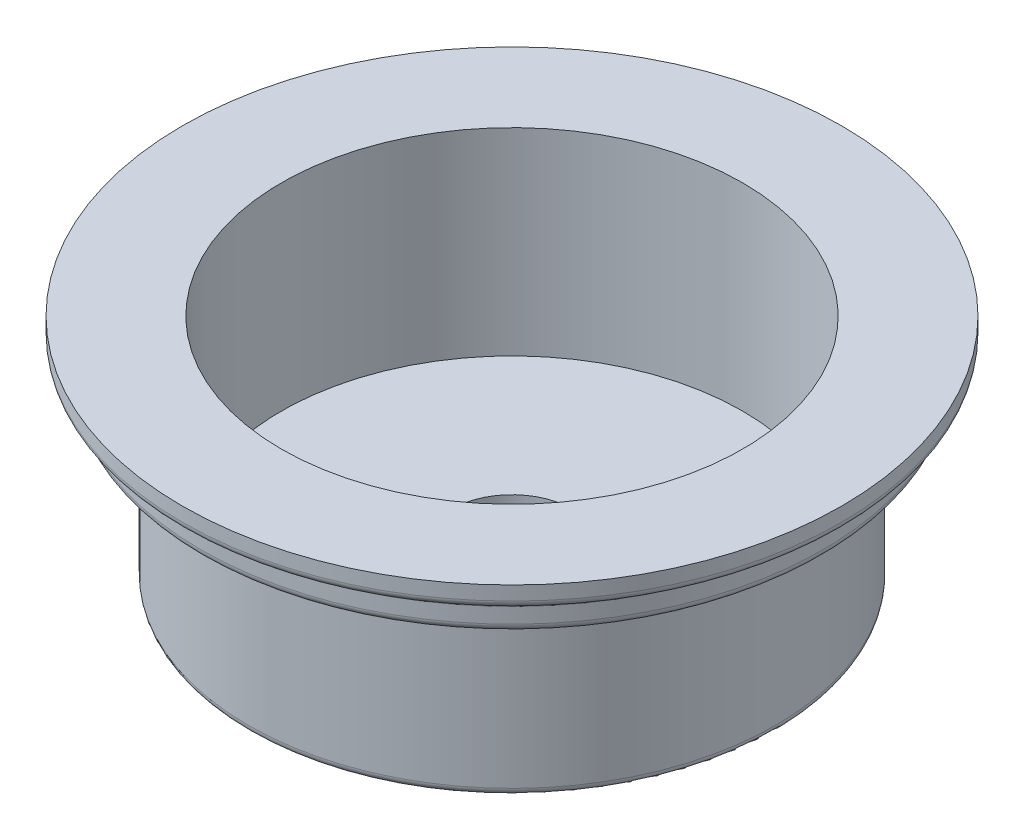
ISO-10303-21;
HEADER;
FILE_DESCRIPTION(('STEP AP214'),'2;1');
FILE_NAME('part.step','',(''),(''),'','','');
FILE_SCHEMA(('AUTOMOTIVE_DESIGN { 1 0 10303 214 1 1 1 1 }'));
ENDSEC;
DATA;
#1=APPLICATION_CONTEXT('core data for automotive mechanical design processes');
#2=APPLICATION_PROTOCOL_DEFINITION('international standard','automotive_design',2000,#1);
#3=PRODUCT_CONTEXT('',#1,'mechanical');
#4=PRODUCT('Part','Part','',(#3));
#5=PRODUCT_RELATED_PRODUCT_CATEGORY('part','',(#4));
#6=PRODUCT_DEFINITION_FORMATION('','',#4);
#7=PRODUCT_DEFINITION_CONTEXT('part definition',#1,'design');
#8=PRODUCT_DEFINITION('design','',#6,#7);
#9=PRODUCT_DEFINITION_SHAPE('','',#8);
#10=(LENGTH_UNIT() NAMED_UNIT(*) SI_UNIT(.MILLI.,.METRE.));
#11=(NAMED_UNIT(*) PLANE_ANGLE_UNIT() SI_UNIT($,.RADIAN.));
#12=(NAMED_UNIT(*) SI_UNIT($,.STERADIAN.) SOLID_ANGLE_UNIT());
#13=UNCERTAINTY_MEASURE_WITH_UNIT(LENGTH_MEASURE(1.E-05),#10,'distance_accuracy_value','');
#14=(GEOMETRIC_REPRESENTATION_CONTEXT(3) GLOBAL_UNCERTAINTY_ASSIGNED_CONTEXT((#13)) GLOBAL_UNIT_ASSIGNED_CONTEXT((#10,
#11,#12)) REPRESENTATION_CONTEXT('',''));
#15=CARTESIAN_POINT('',(0.,0.,0.));
#16=DIRECTION('',(0.,0.,1.));
#17=DIRECTION('',(1.,0.,0.));
#18=AXIS2_PLACEMENT_3D('',#15,#16,#17);
#19=CARTESIAN_POINT('',(19.05,-57.15,0.));
#20=DIRECTION('',(0.,1.,0.));
#21=DIRECTION('',(0.,0.,1.));
#22=AXIS2_PLACEMENT_3D('',#19,#20,#21);
#23=PLANE('',#22);
#24=CARTESIAN_POINT('',(0.,-57.149999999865,0.));
#25=DIRECTION('',(0.,-1.,0.));
#26=DIRECTION('',(0.,0.,-1.));
#27=AXIS2_PLACEMENT_3D('',#24,#25,#26);
#28=CIRCLE('',#27,13.1445);
#29=CARTESIAN_POINT('',(0.,-57.149999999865,-13.1445));
#30=VERTEX_POINT('',#29);
#31=EDGE_CURVE('E93',#30,#30,#28,.T.);
#32=ORIENTED_EDGE('',*,*,#31,.F.);
#33=EDGE_LOOP('',(#32));
#34=FACE_BOUND('',#33,.T.);
#35=CARTESIAN_POINT('',(0.,-57.15,0.));
#36=DIRECTION('',(0.,1.,0.));
#37=DIRECTION('',(0.,0.,1.));
#38=AXIS2_PLACEMENT_3D('',#35,#36,#37);
#39=CIRCLE('',#38,18.6902324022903);
#40=CARTESIAN_POINT('',(0.,-57.15,18.6902324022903));
#41=VERTEX_POINT('',#40);
#42=EDGE_CURVE('E72',#41,#41,#39,.F.);
#43=ORIENTED_EDGE('',*,*,#42,.T.);
#44=EDGE_LOOP('',(#43));
#45=FACE_BOUND('',#44,.T.);
#46=ADVANCED_FACE('F32',(#34,#45),#23,.F.);
#47=CARTESIAN_POINT('',(0.,-57.15,0.));
#48=DIRECTION('',(0.,1.,0.));
#49=DIRECTION('',(0.,0.,1.));
#50=AXIS2_PLACEMENT_3D('',#47,#48,#49);
#51=CONICAL_SURFACE('',#50,19.05,1.10714871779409);
#52=CARTESIAN_POINT('',(0.,-56.9891070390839,0.));
#53=DIRECTION('',(0.,-1.,0.));
#54=DIRECTION('',(0.,0.,-1.));
#55=AXIS2_PLACEMENT_3D('',#52,#53,#54);
#56=CIRCLE('',#55,19.3717859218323);
#57=CARTESIAN_POINT('',(0.,-56.9891070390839,-19.3717859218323));
#58=VERTEX_POINT('',#57);
#59=EDGE_CURVE('E75',#58,#58,#56,.F.);
#60=ORIENTED_EDGE('',*,*,#59,.T.);
#61=EDGE_LOOP('',(#60));
#62=FACE_BOUND('',#61,.T.);
#63=CARTESIAN_POINT('',(0.,-44.6108929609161,0.));
#64=DIRECTION('',(0.,1.,0.));
#65=DIRECTION('',(0.,0.,1.));
#66=AXIS2_PLACEMENT_3D('',#63,#64,#65);
#67=CIRCLE('',#66,44.1282140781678);
#68=CARTESIAN_POINT('',(0.,-44.6108929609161,44.1282140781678));
#69=VERTEX_POINT('',#68);
#70=EDGE_CURVE('E78',#69,#69,#67,.F.);
#71=ORIENTED_EDGE('',*,*,#70,.T.);
#72=EDGE_LOOP('',(#71));
#73=FACE_BOUND('',#72,.T.);
#74=ADVANCED_FACE('F121',(#62,#73),#51,.T.);
#75=CARTESIAN_POINT('',(50.8,-44.45,0.));
#76=DIRECTION('',(0.,1.,0.));
#77=DIRECTION('',(0.,0.,1.));
#78=AXIS2_PLACEMENT_3D('',#75,#76,#77);
#79=PLANE('',#78);
#80=CARTESIAN_POINT('',(0.,-44.45,0.));
#81=DIRECTION('',(0.,1.,0.));
#82=DIRECTION('',(0.,0.,1.));
#83=AXIS2_PLACEMENT_3D('',#80,#81,#82);
#84=CIRCLE('',#83,44.8097675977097);
#85=CARTESIAN_POINT('',(0.,-44.45,44.8097675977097));
#86=VERTEX_POINT('',#85);
#87=EDGE_CURVE('E66',#86,#86,#84,.T.);
#88=ORIENTED_EDGE('',*,*,#87,.T.);
#89=EDGE_LOOP('',(#88));
#90=FACE_BOUND('',#89,.T.);
#91=CARTESIAN_POINT('',(0.,-44.45,0.));
#92=DIRECTION('',(0.,1.,0.));
#93=DIRECTION('',(0.,0.,1.));
#94=AXIS2_PLACEMENT_3D('',#91,#92,#93);
#95=CIRCLE('',#94,49.276);
#96=CARTESIAN_POINT('',(0.,-44.45,49.276));
#97=VERTEX_POINT('',#96);
#98=EDGE_CURVE('E69',#97,#97,#95,.F.);
#99=ORIENTED_EDGE('',*,*,#98,.T.);
#100=EDGE_LOOP('',(#99));
#101=FACE_BOUND('',#100,.T.);
#102=ADVANCED_FACE('F134',(#90,#101),#79,.F.);
#103=CARTESIAN_POINT('',(0.,0.,0.));
#104=DIRECTION('',(0.,1.,0.));
#105=DIRECTION('',(0.,0.,1.));
#106=AXIS2_PLACEMENT_3D('',#103,#104,#105);
#107=CYLINDRICAL_SURFACE('',#106,50.8);
#108=CARTESIAN_POINT('',(0.,-42.926,0.));
#109=DIRECTION('',(0.,1.,0.));
#110=DIRECTION('',(0.,0.,1.));
#111=AXIS2_PLACEMENT_3D('',#108,#109,#110);
#112=CIRCLE('',#111,50.8);
#113=CARTESIAN_POINT('',(0.,-42.926,50.8));
#114=VERTEX_POINT('',#113);
#115=EDGE_CURVE('E60',#114,#114,#112,.T.);
#116=ORIENTED_EDGE('',*,*,#115,.T.);
#117=EDGE_LOOP('',(#116));
#118=FACE_BOUND('',#117,.T.);
#119=CARTESIAN_POINT('',(0.,-14.5287382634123,0.));
#120=DIRECTION('',(0.,1.,0.));
#121=DIRECTION('',(0.,0.,1.));
#122=AXIS2_PLACEMENT_3D('',#119,#120,#121);
#123=CIRCLE('',#122,50.8);
#124=CARTESIAN_POINT('',(0.,-14.5287382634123,50.8));
#125=VERTEX_POINT('',#124);
#126=EDGE_CURVE('E63',#125,#125,#123,.F.);
#127=ORIENTED_EDGE('',*,*,#126,.T.);
#128=EDGE_LOOP('',(#127));
#129=FACE_BOUND('',#128,.T.);
#130=ADVANCED_FACE('F145',(#118,#129),#107,.T.);
#131=CARTESIAN_POINT('',(0.,-13.4616219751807,0.));
#132=DIRECTION('',(0.,1.,0.));
#133=DIRECTION('',(0.,0.,1.));
#134=AXIS2_PLACEMENT_3D('',#131,#132,#133);
#135=CONICAL_SURFACE('',#134,50.8,1.22173047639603);
#136=CARTESIAN_POINT('',(0.,-10.5076982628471,0.));
#137=DIRECTION('',(0.,-1.,0.));
#138=DIRECTION('',(0.,0.,-1.));
#139=AXIS2_PLACEMENT_3D('',#136,#137,#138);
#140=CIRCLE('',#139,58.9158386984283);
#141=CARTESIAN_POINT('',(0.,-10.5076982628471,-58.9158386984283));
#142=VERTEX_POINT('',#141);
#143=EDGE_CURVE('E10',#142,#142,#140,.T.);
#144=ORIENTED_EDGE('',*,*,#143,.T.);
#145=EDGE_LOOP('',(#144));
#146=FACE_BOUND('',#145,.T.);
#147=CARTESIAN_POINT('',(0.,-13.0966467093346,0.));
#148=DIRECTION('',(0.,1.,0.));
#149=DIRECTION('',(0.,0.,1.));
#150=AXIS2_PLACEMENT_3D('',#147,#148,#149);
#151=CIRCLE('',#150,51.8027613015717);
#152=CARTESIAN_POINT('',(0.,-13.0966467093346,51.8027613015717));
#153=VERTEX_POINT('',#152);
#154=EDGE_CURVE('E39',#153,#153,#151,.T.);
#155=ORIENTED_EDGE('',*,*,#154,.T.);
#156=EDGE_LOOP('',(#155));
#157=FACE_BOUND('',#156,.T.);
#158=ADVANCED_FACE('F157',(#146,#157),#135,.T.);
#159=CARTESIAN_POINT('',(0.,0.,0.));
#160=DIRECTION('',(0.,1.,0.));
#161=DIRECTION('',(0.,0.,1.));
#162=AXIS2_PLACEMENT_3D('',#159,#160,#161);
#163=CYLINDRICAL_SURFACE('',#162,59.9186);
#164=CARTESIAN_POINT('',(0.,-6.12983928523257,0.));
#165=DIRECTION('',(0.,1.,0.));
#166=DIRECTION('',(0.,0.,1.));
#167=AXIS2_PLACEMENT_3D('',#164,#165,#166);
#168=CIRCLE('',#167,59.9186);
#169=CARTESIAN_POINT('',(0.,-6.12983928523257,59.9186));
#170=VERTEX_POINT('',#169);
#171=EDGE_CURVE('E48',#170,#170,#168,.F.);
#172=ORIENTED_EDGE('',*,*,#171,.T.);
#173=EDGE_LOOP('',(#172));
#174=FACE_BOUND('',#173,.T.);
#175=CARTESIAN_POINT('',(0.,-9.07560670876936,0.));
#176=DIRECTION('',(0.,-1.,0.));
#177=DIRECTION('',(0.,0.,-1.));
#178=AXIS2_PLACEMENT_3D('',#175,#176,#177);
#179=CIRCLE('',#178,59.9186);
#180=CARTESIAN_POINT('',(0.,-9.07560670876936,-59.9186));
#181=VERTEX_POINT('',#180);
#182=EDGE_CURVE('E51',#181,#181,#179,.F.);
#183=ORIENTED_EDGE('',*,*,#182,.T.);
#184=EDGE_LOOP('',(#183));
#185=FACE_BOUND('',#184,.T.);
#186=ADVANCED_FACE('F168',(#174,#185),#163,.T.);
#187=CARTESIAN_POINT('',(0.,-5.06272299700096,0.));
#188=DIRECTION('',(0.,1.,0.));
#189=DIRECTION('',(0.,0.,1.));
#190=AXIS2_PLACEMENT_3D('',#187,#188,#189);
#191=CONICAL_SURFACE('',#190,59.9186,1.22173047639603);
#192=CARTESIAN_POINT('',(0.,-4.69774773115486,0.));
#193=DIRECTION('',(0.,1.,0.));
#194=DIRECTION('',(0.,0.,1.));
#195=AXIS2_PLACEMENT_3D('',#192,#193,#194);
#196=CIRCLE('',#195,60.9213613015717);
#197=CARTESIAN_POINT('',(0.,-4.69774773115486,60.9213613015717));
#198=VERTEX_POINT('',#197);
#199=EDGE_CURVE('E54',#198,#198,#196,.T.);
#200=ORIENTED_EDGE('',*,*,#199,.T.);
#201=EDGE_LOOP('',(#200));
#202=FACE_BOUND('',#201,.T.);
#203=CARTESIAN_POINT('',(0.,-4.12417526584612,0.));
#204=DIRECTION('',(0.,-1.,0.));
#205=DIRECTION('',(0.,0.,-1.));
#206=AXIS2_PLACEMENT_3D('',#203,#204,#205);
#207=CIRCLE('',#206,62.4972386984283);
#208=CARTESIAN_POINT('',(0.,-4.12417526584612,-62.4972386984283));
#209=VERTEX_POINT('',#208);
#210=EDGE_CURVE('E57',#209,#209,#207,.T.);
#211=ORIENTED_EDGE('',*,*,#210,.T.);
#212=EDGE_LOOP('',(#211));
#213=FACE_BOUND('',#212,.T.);
#214=ADVANCED_FACE('F173',(#202,#213),#191,.T.);
#215=CARTESIAN_POINT('',(0.,0.,0.));
#216=DIRECTION('',(0.,1.,0.));
#217=DIRECTION('',(0.,0.,1.));
#218=AXIS2_PLACEMENT_3D('',#215,#216,#217);
#219=CYLINDRICAL_SURFACE('',#218,63.5);
#220=CARTESIAN_POINT('',(0.,-2.6920837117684,0.));
#221=DIRECTION('',(0.,-1.,0.));
#222=DIRECTION('',(0.,0.,-1.));
#223=AXIS2_PLACEMENT_3D('',#220,#221,#222);
#224=CIRCLE('',#223,63.5);
#225=CARTESIAN_POINT('',(0.,-2.6920837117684,-63.5));
#226=VERTEX_POINT('',#225);
#227=EDGE_CURVE('E43',#226,#226,#224,.F.);
#228=ORIENTED_EDGE('',*,*,#227,.T.);
#229=EDGE_LOOP('',(#228));
#230=FACE_BOUND('',#229,.T.);
#231=CARTESIAN_POINT('',(0.,0.,0.));
#232=DIRECTION('',(0.,1.,0.));
#233=DIRECTION('',(0.,0.,1.));
#234=AXIS2_PLACEMENT_3D('',#231,#232,#233);
#235=CIRCLE('',#234,63.5);
#236=CARTESIAN_POINT('',(0.,0.,63.5));
#237=VERTEX_POINT('',#236);
#238=EDGE_CURVE('E81',#237,#237,#235,.T.);
#239=ORIENTED_EDGE('',*,*,#238,.F.);
#240=EDGE_LOOP('',(#239));
#241=FACE_BOUND('',#240,.T.);
#242=ADVANCED_FACE('F179',(#230,#241),#219,.T.);
#243=CARTESIAN_POINT('',(54.7751,0.,0.));
#244=DIRECTION('',(0.,-1.,0.));
#245=DIRECTION('',(0.,0.,-1.));
#246=AXIS2_PLACEMENT_3D('',#243,#244,#245);
#247=PLANE('',#246);
#248=CARTESIAN_POINT('',(0.,0.,0.));
#249=DIRECTION('',(0.,1.,0.));
#250=DIRECTION('',(0.,0.,1.));
#251=AXIS2_PLACEMENT_3D('',#248,#249,#250);
#252=CIRCLE('',#251,44.45);
#253=CARTESIAN_POINT('',(0.,0.,44.45));
#254=VERTEX_POINT('',#253);
#255=EDGE_CURVE('E84',#254,#254,#252,.T.);
#256=ORIENTED_EDGE('',*,*,#255,.F.);
#257=EDGE_LOOP('',(#256));
#258=FACE_BOUND('',#257,.T.);
#259=ORIENTED_EDGE('',*,*,#238,.T.);
#260=EDGE_LOOP('',(#259));
#261=FACE_BOUND('',#260,.T.);
#262=ADVANCED_FACE('F183',(#258,#261),#247,.F.);
#263=CARTESIAN_POINT('',(0.,0.,0.));
#264=DIRECTION('',(0.,1.,0.));
#265=DIRECTION('',(0.,0.,1.));
#266=AXIS2_PLACEMENT_3D('',#263,#264,#265);
#267=CYLINDRICAL_SURFACE('',#266,44.45);
#268=CARTESIAN_POINT('',(0.,-38.1,0.));
#269=DIRECTION('',(0.,1.,0.));
#270=DIRECTION('',(0.,0.,1.));
#271=AXIS2_PLACEMENT_3D('',#268,#269,#270);
#272=CIRCLE('',#271,44.45);
#273=CARTESIAN_POINT('',(0.,-38.1,44.45));
#274=VERTEX_POINT('',#273);
#275=EDGE_CURVE('E87',#274,#274,#272,.T.);
#276=ORIENTED_EDGE('',*,*,#275,.F.);
#277=EDGE_LOOP('',(#276));
#278=FACE_BOUND('',#277,.T.);
#279=ORIENTED_EDGE('',*,*,#255,.T.);
#280=EDGE_LOOP('',(#279));
#281=FACE_BOUND('',#280,.T.);
#282=ADVANCED_FACE('F187',(#278,#281),#267,.F.);
#283=CARTESIAN_POINT('',(0.,-38.1,0.));
#284=DIRECTION('',(0.,-1.,0.));
#285=DIRECTION('',(0.,0.,-1.));
#286=AXIS2_PLACEMENT_3D('',#283,#284,#285);
#287=PLANE('',#286);
#288=CARTESIAN_POINT('',(0.,-38.1,0.));
#289=DIRECTION('',(0.,-1.,0.));
#290=DIRECTION('',(0.,0.,-1.));
#291=AXIS2_PLACEMENT_3D('',#288,#289,#290);
#292=CIRCLE('',#291,11.6967);
#293=CARTESIAN_POINT('',(0.,-38.1,-11.6967));
#294=VERTEX_POINT('',#293);
#295=EDGE_CURVE('E96',#294,#294,#292,.T.);
#296=ORIENTED_EDGE('',*,*,#295,.T.);
#297=EDGE_LOOP('',(#296));
#298=FACE_BOUND('',#297,.T.);
#299=ORIENTED_EDGE('',*,*,#275,.T.);
#300=EDGE_LOOP('',(#299));
#301=FACE_BOUND('',#300,.T.);
#302=ADVANCED_FACE('F128',(#298,#301),#287,.F.);
#303=CARTESIAN_POINT('',(0.,-55.626,0.));
#304=DIRECTION('',(0.,1.,0.));
#305=DIRECTION('',(0.,0.,1.));
#306=AXIS2_PLACEMENT_3D('',#303,#304,#305);
#307=TOROIDAL_SURFACE('',#306,18.6902324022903,1.524);
#308=ORIENTED_EDGE('',*,*,#42,.F.);
#309=EDGE_LOOP('',(#308));
#310=FACE_BOUND('',#309,.T.);
#311=ORIENTED_EDGE('',*,*,#59,.F.);
#312=EDGE_LOOP('',(#311));
#313=FACE_BOUND('',#312,.T.);
#314=ADVANCED_FACE('F124',(#310,#313),#307,.T.);
#315=CARTESIAN_POINT('',(0.,-45.974,0.));
#316=DIRECTION('',(0.,1.,0.));
#317=DIRECTION('',(0.,0.,1.));
#318=AXIS2_PLACEMENT_3D('',#315,#316,#317);
#319=TOROIDAL_SURFACE('',#318,44.8097675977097,1.524);
#320=ORIENTED_EDGE('',*,*,#70,.F.);
#321=EDGE_LOOP('',(#320));
#322=FACE_BOUND('',#321,.T.);
#323=ORIENTED_EDGE('',*,*,#87,.F.);
#324=EDGE_LOOP('',(#323));
#325=FACE_BOUND('',#324,.T.);
#326=ADVANCED_FACE('F127',(#322,#325),#319,.F.);
#327=CARTESIAN_POINT('',(0.,-42.926,0.));
#328=DIRECTION('',(0.,1.,0.));
#329=DIRECTION('',(0.,0.,1.));
#330=AXIS2_PLACEMENT_3D('',#327,#328,#329);
#331=TOROIDAL_SURFACE('',#330,49.276,1.524);
#332=ORIENTED_EDGE('',*,*,#98,.F.);
#333=EDGE_LOOP('',(#332));
#334=FACE_BOUND('',#333,.T.);
#335=ORIENTED_EDGE('',*,*,#115,.F.);
#336=EDGE_LOOP('',(#335));
#337=FACE_BOUND('',#336,.T.);
#338=ADVANCED_FACE('F139',(#334,#337),#331,.T.);
#339=CARTESIAN_POINT('',(0.,-6.12983928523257,0.));
#340=DIRECTION('',(0.,1.,0.));
#341=DIRECTION('',(0.,0.,1.));
#342=AXIS2_PLACEMENT_3D('',#339,#340,#341);
#343=TOROIDAL_SURFACE('',#342,61.4426,1.524);
#344=ORIENTED_EDGE('',*,*,#171,.F.);
#345=EDGE_LOOP('',(#344));
#346=FACE_BOUND('',#345,.T.);
#347=ORIENTED_EDGE('',*,*,#199,.F.);
#348=EDGE_LOOP('',(#347));
#349=FACE_BOUND('',#348,.T.);
#350=ADVANCED_FACE('F151',(#346,#349),#343,.F.);
#351=CARTESIAN_POINT('',(0.,-2.6920837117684,0.));
#352=DIRECTION('',(0.,-1.,0.));
#353=DIRECTION('',(0.,0.,-1.));
#354=AXIS2_PLACEMENT_3D('',#351,#352,#353);
#355=TOROIDAL_SURFACE('',#354,61.976,1.524);
#356=ORIENTED_EDGE('',*,*,#210,.F.);
#357=EDGE_LOOP('',(#356));
#358=FACE_BOUND('',#357,.T.);
#359=ORIENTED_EDGE('',*,*,#227,.F.);
#360=EDGE_LOOP('',(#359));
#361=FACE_BOUND('',#360,.T.);
#362=ADVANCED_FACE('F196',(#358,#361),#355,.T.);
#363=CARTESIAN_POINT('',(0.,-9.07560670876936,0.));
#364=DIRECTION('',(0.,-1.,0.));
#365=DIRECTION('',(0.,0.,-1.));
#366=AXIS2_PLACEMENT_3D('',#363,#364,#365);
#367=TOROIDAL_SURFACE('',#366,58.3946,1.524);
#368=ORIENTED_EDGE('',*,*,#143,.F.);
#369=EDGE_LOOP('',(#368));
#370=FACE_BOUND('',#369,.T.);
#371=ORIENTED_EDGE('',*,*,#182,.F.);
#372=EDGE_LOOP('',(#371));
#373=FACE_BOUND('',#372,.T.);
#374=ADVANCED_FACE('F163',(#370,#373),#367,.T.);
#375=CARTESIAN_POINT('',(0.,-14.5287382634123,0.));
#376=DIRECTION('',(0.,1.,0.));
#377=DIRECTION('',(0.,0.,1.));
#378=AXIS2_PLACEMENT_3D('',#375,#376,#377);
#379=TOROIDAL_SURFACE('',#378,52.324,1.524);
#380=ORIENTED_EDGE('',*,*,#126,.F.);
#381=EDGE_LOOP('',(#380));
#382=FACE_BOUND('',#381,.T.);
#383=ORIENTED_EDGE('',*,*,#154,.F.);
#384=EDGE_LOOP('',(#383));
#385=FACE_BOUND('',#384,.T.);
#386=ADVANCED_FACE('F115',(#382,#385),#379,.F.);
#387=CARTESIAN_POINT('',(0.,-57.149999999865,0.));
#388=DIRECTION('',(0.,-1.,0.));
#389=DIRECTION('',(0.,0.,-1.));
#390=AXIS2_PLACEMENT_3D('',#387,#388,#389);
#391=CONICAL_SURFACE('',#390,13.1445,0.0311250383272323);
#392=CARTESIAN_POINT('',(0.,-43.096179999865,0.));
#393=DIRECTION('',(0.,-1.,0.));
#394=DIRECTION('',(0.,0.,-1.));
#395=AXIS2_PLACEMENT_3D('',#392,#393,#394);
#396=CIRCLE('',#395,12.7069330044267);
#397=CARTESIAN_POINT('',(0.,-43.096179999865,-12.7069330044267));
#398=VERTEX_POINT('',#397);
#399=EDGE_CURVE('E90',#398,#398,#396,.T.);
#400=ORIENTED_EDGE('',*,*,#399,.F.);
#401=EDGE_LOOP('',(#400));
#402=FACE_BOUND('',#401,.T.);
#403=ORIENTED_EDGE('',*,*,#31,.T.);
#404=EDGE_LOOP('',(#403));
#405=FACE_BOUND('',#404,.T.);
#406=ADVANCED_FACE('F109',(#402,#405),#391,.F.);
#407=CARTESIAN_POINT('',(0.,-43.096179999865,0.));
#408=DIRECTION('',(0.,-1.,0.));
#409=DIRECTION('',(0.,0.,-1.));
#410=AXIS2_PLACEMENT_3D('',#407,#408,#409);
#411=PLANE('',#410);
#412=CARTESIAN_POINT('',(0.,-43.096179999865,0.));
#413=DIRECTION('',(0.,-1.,0.));
#414=DIRECTION('',(0.,0.,-1.));
#415=AXIS2_PLACEMENT_3D('',#412,#413,#414);
#416=CIRCLE('',#415,11.6967);
#417=CARTESIAN_POINT('',(0.,-43.096179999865,-11.6967));
#418=VERTEX_POINT('',#417);
#419=EDGE_CURVE('E35',#418,#418,#416,.T.);
#420=ORIENTED_EDGE('',*,*,#419,.F.);
#421=EDGE_LOOP('',(#420));
#422=FACE_BOUND('',#421,.T.);
#423=ORIENTED_EDGE('',*,*,#399,.T.);
#424=EDGE_LOOP('',(#423));
#425=FACE_BOUND('',#424,.T.);
#426=ADVANCED_FACE('F106',(#422,#425),#411,.T.);
#427=CARTESIAN_POINT('',(0.,-19.05,0.));
#428=DIRECTION('',(0.,-1.,0.));
#429=DIRECTION('',(0.,0.,-1.));
#430=AXIS2_PLACEMENT_3D('',#427,#428,#429);
#431=CYLINDRICAL_SURFACE('',#430,11.6967);
#432=CARTESIAN_POINT('',(0.,-43.096179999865,-11.6967));
#433=CARTESIAN_POINT('',(0.,-43.0441364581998,-11.6967));
#434=CARTESIAN_POINT('',(0.,-42.9920929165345,-11.6967));
#435=CARTESIAN_POINT('',(0.,-42.888005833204,-11.6967));
#436=CARTESIAN_POINT('',(0.,-42.8359622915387,-11.6967));
#437=CARTESIAN_POINT('',(0.,-42.7318752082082,-11.6967));
#438=CARTESIAN_POINT('',(0.,-42.6798316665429,-11.6967));
#439=CARTESIAN_POINT('',(0.,-42.5757445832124,-11.6967));
#440=CARTESIAN_POINT('',(0.,-42.5237010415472,-11.6967));
#441=CARTESIAN_POINT('',(0.,-42.4196139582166,-11.6967));
#442=CARTESIAN_POINT('',(0.,-42.3675704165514,-11.6967));
#443=CARTESIAN_POINT('',(0.,-42.2634833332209,-11.6967));
#444=CARTESIAN_POINT('',(0.,-42.2114397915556,-11.6967));
#445=CARTESIAN_POINT('',(0.,-42.1073527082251,-11.6967));
#446=CARTESIAN_POINT('',(0.,-42.0553091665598,-11.6967));
#447=CARTESIAN_POINT('',(0.,-41.9512220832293,-11.6967));
#448=CARTESIAN_POINT('',(0.,-41.899178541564,-11.6967));
#449=CARTESIAN_POINT('',(0.,-41.7950914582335,-11.6967));
#450=CARTESIAN_POINT('',(0.,-41.7430479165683,-11.6967));
#451=CARTESIAN_POINT('',(0.,-41.6389608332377,-11.6967));
#452=CARTESIAN_POINT('',(0.,-41.5869172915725,-11.6967));
#453=CARTESIAN_POINT('',(0.,-41.4828302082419,-11.6967));
#454=CARTESIAN_POINT('',(0.,-41.4307866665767,-11.6967));
#455=CARTESIAN_POINT('',(0.,-41.3266995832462,-11.6967));
#456=CARTESIAN_POINT('',(0.,-41.2746560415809,-11.6967));
#457=CARTESIAN_POINT('',(0.,-41.1705689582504,-11.6967));
#458=CARTESIAN_POINT('',(0.,-41.1185254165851,-11.6967));
#459=CARTESIAN_POINT('',(0.,-41.0144383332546,-11.6967));
#460=CARTESIAN_POINT('',(0.,-40.9623947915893,-11.6967));
#461=CARTESIAN_POINT('',(0.,-40.8583077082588,-11.6967));
#462=CARTESIAN_POINT('',(0.,-40.8062641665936,-11.6967));
#463=CARTESIAN_POINT('',(0.,-40.702177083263,-11.6967));
#464=CARTESIAN_POINT('',(0.,-40.6501335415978,-11.6967));
#465=CARTESIAN_POINT('',(0.,-40.5460464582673,-11.6967));
#466=CARTESIAN_POINT('',(0.,-40.494002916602,-11.6967));
#467=CARTESIAN_POINT('',(0.,-40.3899158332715,-11.6967));
#468=CARTESIAN_POINT('',(0.,-40.3378722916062,-11.6967));
#469=CARTESIAN_POINT('',(0.,-40.2337852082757,-11.6967));
#470=CARTESIAN_POINT('',(0.,-40.1817416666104,-11.6967));
#471=CARTESIAN_POINT('',(0.,-40.0776545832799,-11.6967));
#472=CARTESIAN_POINT('',(0.,-40.0256110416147,-11.6967));
#473=CARTESIAN_POINT('',(0.,-39.9215239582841,-11.6967));
#474=CARTESIAN_POINT('',(0.,-39.8694804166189,-11.6967));
#475=CARTESIAN_POINT('',(0.,-39.7653933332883,-11.6967));
#476=CARTESIAN_POINT('',(0.,-39.7133497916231,-11.6967));
#477=CARTESIAN_POINT('',(0.,-39.6092627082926,-11.6967));
#478=CARTESIAN_POINT('',(0.,-39.5572191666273,-11.6967));
#479=CARTESIAN_POINT('',(0.,-39.4531320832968,-11.6967));
#480=CARTESIAN_POINT('',(0.,-39.4010885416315,-11.6967));
#481=CARTESIAN_POINT('',(0.,-39.297001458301,-11.6967));
#482=CARTESIAN_POINT('',(0.,-39.2449579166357,-11.6967));
#483=CARTESIAN_POINT('',(0.,-39.1408708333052,-11.6967));
#484=CARTESIAN_POINT('',(0.,-39.08882729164,-11.6967));
#485=CARTESIAN_POINT('',(0.,-38.9847402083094,-11.6967));
#486=CARTESIAN_POINT('',(0.,-38.9326966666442,-11.6967));
#487=CARTESIAN_POINT('',(0.,-38.8286095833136,-11.6967));
#488=CARTESIAN_POINT('',(0.,-38.7765660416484,-11.6967));
#489=CARTESIAN_POINT('',(0.,-38.6724789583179,-11.6967));
#490=CARTESIAN_POINT('',(0.,-38.6204354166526,-11.6967));
#491=CARTESIAN_POINT('',(0.,-38.5163483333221,-11.6967));
#492=CARTESIAN_POINT('',(0.,-38.4643047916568,-11.6967));
#493=CARTESIAN_POINT('',(0.,-38.3602177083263,-11.6967));
#494=CARTESIAN_POINT('',(0.,-38.308174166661,-11.6967));
#495=CARTESIAN_POINT('',(0.,-38.2040870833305,-11.6967));
#496=CARTESIAN_POINT('',(0.,-38.1520435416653,-11.6967));
#497=CARTESIAN_POINT('',(0.,-38.1,-11.6967));
#498=B_SPLINE_CURVE_WITH_KNOTS('',3,(#432,#433,#434,#435,#436,#437,#438,#439,#440,#441,#442,
#443,#444,#445,#446,#447,#448,#449,#450,#451,#452,#453,#454,#455,#456,#457,#458,#459,#460,#461,
#462,#463,#464,#465,#466,#467,#468,#469,#470,#471,#472,#473,#474,#475,#476,#477,#478,#479,#480,
#481,#482,#483,#484,#485,#486,#487,#488,#489,#490,#491,#492,#493,#494,#495,#496,#497),
.UNSPECIFIED.,.F.,.F.,(4,2,2,2,2,2,2,2,2,2,2,2,2,2,2,2,2,2,2,2,2,2,2,2,2,2,2,2,2,2,2,2,4),(0.,
0.156130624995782,0.312261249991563,0.468391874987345,0.624522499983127,0.780653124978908,
0.93678374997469,1.09291437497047,1.24904499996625,1.40517562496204,1.56130624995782,
1.7174368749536,1.87356749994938,2.02969812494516,2.18582874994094,2.34195937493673,
2.49808999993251,2.65422062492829,2.81035124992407,2.96648187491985,3.12261249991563,
3.27874312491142,3.4348737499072,3.59100437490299,3.74713499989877,3.90326562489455,
4.05939624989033,4.21552687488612,4.3716574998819,4.52778812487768,4.68391874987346,
4.84004937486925,4.99617999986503),.UNSPECIFIED.);
#499=EDGE_CURVE('BSEAM103',#418,#294,#498,.T.);
#500=ORIENTED_EDGE('',*,*,#419,.T.);
#501=ORIENTED_EDGE('',*,*,#295,.F.);
#502=ORIENTED_EDGE('',*,*,#499,.T.);
#503=ORIENTED_EDGE('',*,*,#499,.F.);
#504=EDGE_LOOP('',(#500,#502,#501,#503));
#505=FACE_BOUND('',#504,.T.);
#506=ADVANCED_FACE('F103',(#505),#431,.F.);
#507=CLOSED_SHELL('',(#46,#74,#102,#130,#158,#186,#214,#242,#262,#282,#302,#314,#326,#338,#350,
#362,#374,#386,#406,#426,#506));
#508=MANIFOLD_SOLID_BREP('B2',#507);
#509=ADVANCED_BREP_SHAPE_REPRESENTATION('',(#18,#508),#14);
#510=SHAPE_DEFINITION_REPRESENTATION(#9,#509);
ENDSEC;
END-ISO-10303-21;
